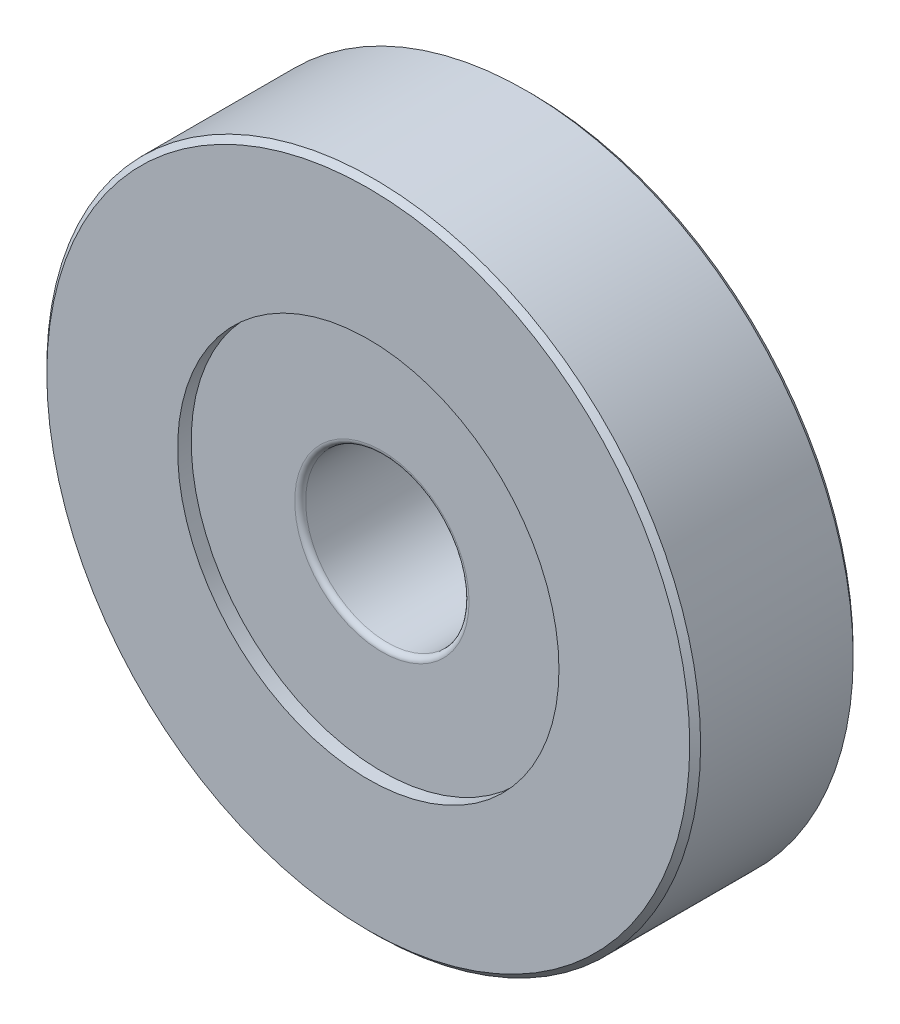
ISO-10303-21;
HEADER;
FILE_DESCRIPTION(('STEP AP214'),'2;1');
FILE_NAME('part.step','',(''),(''),'','','');
FILE_SCHEMA(('AUTOMOTIVE_DESIGN { 1 0 10303 214 1 1 1 1 }'));
ENDSEC;
DATA;
#1=APPLICATION_CONTEXT('core data for automotive mechanical design processes');
#2=APPLICATION_PROTOCOL_DEFINITION('international standard','automotive_design',2000,#1);
#3=PRODUCT_CONTEXT('',#1,'mechanical');
#4=PRODUCT('Part','Part','',(#3));
#5=PRODUCT_RELATED_PRODUCT_CATEGORY('part','',(#4));
#6=PRODUCT_DEFINITION_FORMATION('','',#4);
#7=PRODUCT_DEFINITION_CONTEXT('part definition',#1,'design');
#8=PRODUCT_DEFINITION('design','',#6,#7);
#9=PRODUCT_DEFINITION_SHAPE('','',#8);
#10=(LENGTH_UNIT() NAMED_UNIT(*) SI_UNIT(.MILLI.,.METRE.));
#11=(NAMED_UNIT(*) PLANE_ANGLE_UNIT() SI_UNIT($,.RADIAN.));
#12=(NAMED_UNIT(*) SI_UNIT($,.STERADIAN.) SOLID_ANGLE_UNIT());
#13=UNCERTAINTY_MEASURE_WITH_UNIT(LENGTH_MEASURE(1.E-05),#10,'distance_accuracy_value','');
#14=(GEOMETRIC_REPRESENTATION_CONTEXT(3) GLOBAL_UNCERTAINTY_ASSIGNED_CONTEXT((#13)) GLOBAL_UNIT_ASSIGNED_CONTEXT((#10,
#11,#12)) REPRESENTATION_CONTEXT('',''));
#15=CARTESIAN_POINT('',(0.,0.,0.));
#16=DIRECTION('',(0.,0.,1.));
#17=DIRECTION('',(1.,0.,0.));
#18=AXIS2_PLACEMENT_3D('',#15,#16,#17);
#19=CARTESIAN_POINT('',(0.,0.,2.3));
#20=DIRECTION('',(0.,0.,1.));
#21=DIRECTION('',(1.,0.,0.));
#22=AXIS2_PLACEMENT_3D('',#19,#20,#21);
#23=TOROIDAL_SURFACE('',#22,3.2,0.200000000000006);
#24=CARTESIAN_POINT('',(0.,0.,2.3));
#25=DIRECTION('',(0.,0.,1.));
#26=DIRECTION('',(1.,0.,0.));
#27=AXIS2_PLACEMENT_3D('',#24,#25,#26);
#28=CIRCLE('',#27,3.);
#29=CARTESIAN_POINT('',(3.,0.,2.3));
#30=VERTEX_POINT('',#29);
#31=EDGE_CURVE('E8',#30,#30,#28,.T.);
#32=ORIENTED_EDGE('',*,*,#31,.F.);
#33=EDGE_LOOP('',(#32));
#34=FACE_BOUND('',#33,.T.);
#35=CARTESIAN_POINT('',(0.,0.,2.5));
#36=DIRECTION('',(0.,0.,1.));
#37=DIRECTION('',(1.,0.,0.));
#38=AXIS2_PLACEMENT_3D('',#35,#36,#37);
#39=CIRCLE('',#38,3.2);
#40=CARTESIAN_POINT('',(3.2,0.,2.5));
#41=VERTEX_POINT('',#40);
#42=EDGE_CURVE('E52',#41,#41,#39,.T.);
#43=ORIENTED_EDGE('',*,*,#42,.T.);
#44=EDGE_LOOP('',(#43));
#45=FACE_BOUND('',#44,.T.);
#46=ADVANCED_FACE('F12',(#34,#45),#23,.T.);
#47=CARTESIAN_POINT('',(0.,0.,6.));
#48=DIRECTION('',(0.,0.,1.));
#49=DIRECTION('',(1.,0.,0.));
#50=AXIS2_PLACEMENT_3D('',#47,#48,#49);
#51=CYLINDRICAL_SURFACE('',#50,3.);
#52=CARTESIAN_POINT('',(0.,0.,-2.3));
#53=DIRECTION('',(0.,0.,1.));
#54=DIRECTION('',(1.,0.,0.));
#55=AXIS2_PLACEMENT_3D('',#52,#53,#54);
#56=CIRCLE('',#55,3.);
#57=CARTESIAN_POINT('',(3.,0.,-2.3));
#58=VERTEX_POINT('',#57);
#59=EDGE_CURVE('E18',#58,#58,#56,.T.);
#60=ORIENTED_EDGE('',*,*,#59,.F.);
#61=EDGE_LOOP('',(#60));
#62=FACE_BOUND('',#61,.T.);
#63=ORIENTED_EDGE('',*,*,#31,.T.);
#64=EDGE_LOOP('',(#63));
#65=FACE_BOUND('',#64,.T.);
#66=ADVANCED_FACE('F113',(#62,#65),#51,.F.);
#67=CARTESIAN_POINT('',(0.,0.,-2.3));
#68=DIRECTION('',(0.,0.,1.));
#69=DIRECTION('',(1.,0.,0.));
#70=AXIS2_PLACEMENT_3D('',#67,#68,#69);
#71=TOROIDAL_SURFACE('',#70,3.2,0.200000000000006);
#72=CARTESIAN_POINT('',(0.,0.,-2.5));
#73=DIRECTION('',(0.,0.,1.));
#74=DIRECTION('',(1.,0.,0.));
#75=AXIS2_PLACEMENT_3D('',#72,#73,#74);
#76=CIRCLE('',#75,3.2);
#77=CARTESIAN_POINT('',(3.2,0.,-2.5));
#78=VERTEX_POINT('',#77);
#79=EDGE_CURVE('E22',#78,#78,#76,.T.);
#80=ORIENTED_EDGE('',*,*,#79,.F.);
#81=EDGE_LOOP('',(#80));
#82=FACE_BOUND('',#81,.T.);
#83=ORIENTED_EDGE('',*,*,#59,.T.);
#84=EDGE_LOOP('',(#83));
#85=FACE_BOUND('',#84,.T.);
#86=ADVANCED_FACE('F108',(#82,#85),#71,.T.);
#87=CARTESIAN_POINT('',(0.,3.2,-2.5));
#88=DIRECTION('',(0.,0.,1.));
#89=DIRECTION('',(1.,0.,0.));
#90=AXIS2_PLACEMENT_3D('',#87,#88,#89);
#91=PLANE('',#90);
#92=CARTESIAN_POINT('',(0.,0.,-2.5));
#93=DIRECTION('',(0.,0.,1.));
#94=DIRECTION('',(1.,0.,0.));
#95=AXIS2_PLACEMENT_3D('',#92,#93,#94);
#96=CIRCLE('',#95,7.);
#97=CARTESIAN_POINT('',(7.,0.,-2.5));
#98=VERTEX_POINT('',#97);
#99=EDGE_CURVE('E26',#98,#98,#96,.T.);
#100=ORIENTED_EDGE('',*,*,#99,.F.);
#101=EDGE_LOOP('',(#100));
#102=FACE_BOUND('',#101,.T.);
#103=ORIENTED_EDGE('',*,*,#79,.T.);
#104=EDGE_LOOP('',(#103));
#105=FACE_BOUND('',#104,.T.);
#106=ADVANCED_FACE('F102',(#102,#105),#91,.F.);
#107=CARTESIAN_POINT('',(0.,0.,6.));
#108=DIRECTION('',(0.,0.,1.));
#109=DIRECTION('',(1.,0.,0.));
#110=AXIS2_PLACEMENT_3D('',#107,#108,#109);
#111=CYLINDRICAL_SURFACE('',#110,7.);
#112=CARTESIAN_POINT('',(0.,0.,-3.));
#113=DIRECTION('',(0.,0.,1.));
#114=DIRECTION('',(1.,0.,0.));
#115=AXIS2_PLACEMENT_3D('',#112,#113,#114);
#116=CIRCLE('',#115,7.);
#117=CARTESIAN_POINT('',(7.,0.,-3.));
#118=VERTEX_POINT('',#117);
#119=EDGE_CURVE('E31',#118,#118,#116,.T.);
#120=ORIENTED_EDGE('',*,*,#119,.F.);
#121=EDGE_LOOP('',(#120));
#122=FACE_BOUND('',#121,.T.);
#123=ORIENTED_EDGE('',*,*,#99,.T.);
#124=EDGE_LOOP('',(#123));
#125=FACE_BOUND('',#124,.T.);
#126=ADVANCED_FACE('F96',(#122,#125),#111,.F.);
#127=CARTESIAN_POINT('',(0.,11.8,-3.));
#128=DIRECTION('',(0.,0.,1.));
#129=DIRECTION('',(1.,0.,0.));
#130=AXIS2_PLACEMENT_3D('',#127,#128,#129);
#131=PLANE('',#130);
#132=CARTESIAN_POINT('',(0.,0.,-3.));
#133=DIRECTION('',(0.,0.,1.));
#134=DIRECTION('',(1.,0.,0.));
#135=AXIS2_PLACEMENT_3D('',#132,#133,#134);
#136=CIRCLE('',#135,11.8);
#137=CARTESIAN_POINT('',(11.8,0.,-3.));
#138=VERTEX_POINT('',#137);
#139=EDGE_CURVE('E34',#138,#138,#136,.T.);
#140=ORIENTED_EDGE('',*,*,#139,.F.);
#141=EDGE_LOOP('',(#140));
#142=FACE_BOUND('',#141,.T.);
#143=ORIENTED_EDGE('',*,*,#119,.T.);
#144=EDGE_LOOP('',(#143));
#145=FACE_BOUND('',#144,.T.);
#146=ADVANCED_FACE('F90',(#142,#145),#131,.F.);
#147=CARTESIAN_POINT('',(0.,0.,-3.));
#148=DIRECTION('',(0.,0.,1.));
#149=DIRECTION('',(1.,0.,0.));
#150=AXIS2_PLACEMENT_3D('',#147,#148,#149);
#151=CONICAL_SURFACE('',#150,11.8,0.785398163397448);
#152=CARTESIAN_POINT('',(0.,0.,-2.8));
#153=DIRECTION('',(0.,0.,1.));
#154=DIRECTION('',(1.,0.,0.));
#155=AXIS2_PLACEMENT_3D('',#152,#153,#154);
#156=CIRCLE('',#155,12.);
#157=CARTESIAN_POINT('',(12.,0.,-2.8));
#158=VERTEX_POINT('',#157);
#159=EDGE_CURVE('E37',#158,#158,#156,.T.);
#160=ORIENTED_EDGE('',*,*,#159,.F.);
#161=EDGE_LOOP('',(#160));
#162=FACE_BOUND('',#161,.T.);
#163=ORIENTED_EDGE('',*,*,#139,.T.);
#164=EDGE_LOOP('',(#163));
#165=FACE_BOUND('',#164,.T.);
#166=ADVANCED_FACE('F84',(#162,#165),#151,.T.);
#167=CARTESIAN_POINT('',(0.,0.,6.));
#168=DIRECTION('',(0.,0.,1.));
#169=DIRECTION('',(1.,0.,0.));
#170=AXIS2_PLACEMENT_3D('',#167,#168,#169);
#171=CYLINDRICAL_SURFACE('',#170,12.);
#172=CARTESIAN_POINT('',(0.,0.,2.8));
#173=DIRECTION('',(0.,0.,1.));
#174=DIRECTION('',(1.,0.,0.));
#175=AXIS2_PLACEMENT_3D('',#172,#173,#174);
#176=CIRCLE('',#175,12.);
#177=CARTESIAN_POINT('',(12.,0.,2.8));
#178=VERTEX_POINT('',#177);
#179=EDGE_CURVE('E40',#178,#178,#176,.T.);
#180=ORIENTED_EDGE('',*,*,#179,.F.);
#181=EDGE_LOOP('',(#180));
#182=FACE_BOUND('',#181,.T.);
#183=ORIENTED_EDGE('',*,*,#159,.T.);
#184=EDGE_LOOP('',(#183));
#185=FACE_BOUND('',#184,.T.);
#186=ADVANCED_FACE('F78',(#182,#185),#171,.T.);
#187=CARTESIAN_POINT('',(0.,0.,2.8));
#188=DIRECTION('',(0.,0.,-1.));
#189=DIRECTION('',(-1.,0.,0.));
#190=AXIS2_PLACEMENT_3D('',#187,#188,#189);
#191=CONICAL_SURFACE('',#190,12.,0.785398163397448);
#192=CARTESIAN_POINT('',(0.,0.,3.));
#193=DIRECTION('',(0.,0.,1.));
#194=DIRECTION('',(1.,0.,0.));
#195=AXIS2_PLACEMENT_3D('',#192,#193,#194);
#196=CIRCLE('',#195,11.8);
#197=CARTESIAN_POINT('',(11.8,0.,3.));
#198=VERTEX_POINT('',#197);
#199=EDGE_CURVE('E43',#198,#198,#196,.T.);
#200=ORIENTED_EDGE('',*,*,#199,.F.);
#201=EDGE_LOOP('',(#200));
#202=FACE_BOUND('',#201,.T.);
#203=ORIENTED_EDGE('',*,*,#179,.T.);
#204=EDGE_LOOP('',(#203));
#205=FACE_BOUND('',#204,.T.);
#206=ADVANCED_FACE('F72',(#202,#205),#191,.T.);
#207=CARTESIAN_POINT('',(0.,11.8,3.));
#208=DIRECTION('',(0.,0.,-1.));
#209=DIRECTION('',(-1.,0.,0.));
#210=AXIS2_PLACEMENT_3D('',#207,#208,#209);
#211=PLANE('',#210);
#212=CARTESIAN_POINT('',(0.,0.,3.));
#213=DIRECTION('',(0.,0.,1.));
#214=DIRECTION('',(1.,0.,0.));
#215=AXIS2_PLACEMENT_3D('',#212,#213,#214);
#216=CIRCLE('',#215,7.);
#217=CARTESIAN_POINT('',(7.,0.,3.));
#218=VERTEX_POINT('',#217);
#219=EDGE_CURVE('E46',#218,#218,#216,.T.);
#220=ORIENTED_EDGE('',*,*,#219,.F.);
#221=EDGE_LOOP('',(#220));
#222=FACE_BOUND('',#221,.T.);
#223=ORIENTED_EDGE('',*,*,#199,.T.);
#224=EDGE_LOOP('',(#223));
#225=FACE_BOUND('',#224,.T.);
#226=ADVANCED_FACE('F66',(#222,#225),#211,.F.);
#227=CARTESIAN_POINT('',(0.,0.,6.));
#228=DIRECTION('',(0.,0.,1.));
#229=DIRECTION('',(1.,0.,0.));
#230=AXIS2_PLACEMENT_3D('',#227,#228,#229);
#231=CYLINDRICAL_SURFACE('',#230,7.);
#232=CARTESIAN_POINT('',(0.,0.,2.5));
#233=DIRECTION('',(0.,0.,1.));
#234=DIRECTION('',(1.,0.,0.));
#235=AXIS2_PLACEMENT_3D('',#232,#233,#234);
#236=CIRCLE('',#235,7.);
#237=CARTESIAN_POINT('',(7.,0.,2.5));
#238=VERTEX_POINT('',#237);
#239=EDGE_CURVE('E49',#238,#238,#236,.T.);
#240=ORIENTED_EDGE('',*,*,#239,.F.);
#241=EDGE_LOOP('',(#240));
#242=FACE_BOUND('',#241,.T.);
#243=ORIENTED_EDGE('',*,*,#219,.T.);
#244=EDGE_LOOP('',(#243));
#245=FACE_BOUND('',#244,.T.);
#246=ADVANCED_FACE('F60',(#242,#245),#231,.F.);
#247=CARTESIAN_POINT('',(0.,3.2,2.5));
#248=DIRECTION('',(0.,0.,-1.));
#249=DIRECTION('',(-1.,0.,0.));
#250=AXIS2_PLACEMENT_3D('',#247,#248,#249);
#251=PLANE('',#250);
#252=ORIENTED_EDGE('',*,*,#42,.F.);
#253=EDGE_LOOP('',(#252));
#254=FACE_BOUND('',#253,.T.);
#255=ORIENTED_EDGE('',*,*,#239,.T.);
#256=EDGE_LOOP('',(#255));
#257=FACE_BOUND('',#256,.T.);
#258=ADVANCED_FACE('F57',(#254,#257),#251,.F.);
#259=CLOSED_SHELL('',(#46,#66,#86,#106,#126,#146,#166,#186,#206,#226,#246,#258));
#260=MANIFOLD_SOLID_BREP('B1',#259);
#261=ADVANCED_BREP_SHAPE_REPRESENTATION('',(#18,#260),#14);
#262=SHAPE_DEFINITION_REPRESENTATION(#9,#261);
ENDSEC;
END-ISO-10303-21;
